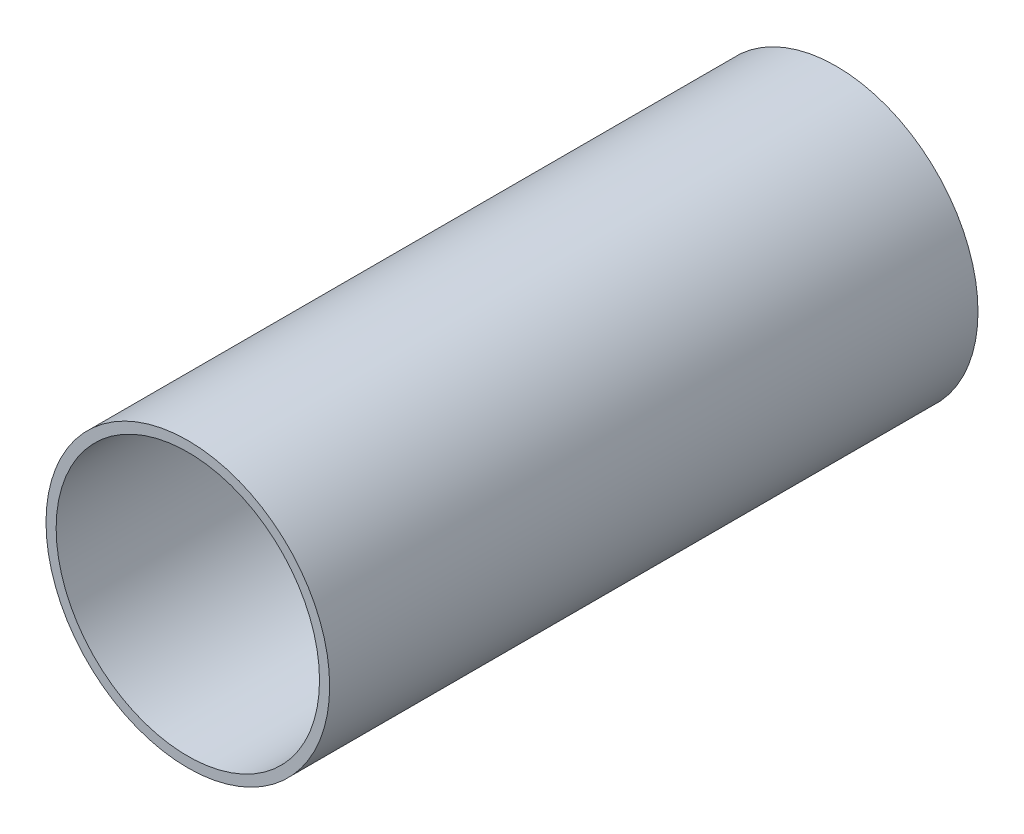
from build123d import *

# Parameters (mm, degrees)
SKETCH1_R      = 22.225
SKETCH1_R_2    = 20.6375
EXTRUDE1_DEPTH = 101.6


with BuildPart() as part:
    # Sketch1 → Extrude1 (new body)
    with BuildSketch(Plane.XY):
        Circle(SKETCH1_R)
        Circle(SKETCH1_R_2, mode=Mode.SUBTRACT)
    extrude(amount=EXTRUDE1_DEPTH)


solid = part.part
